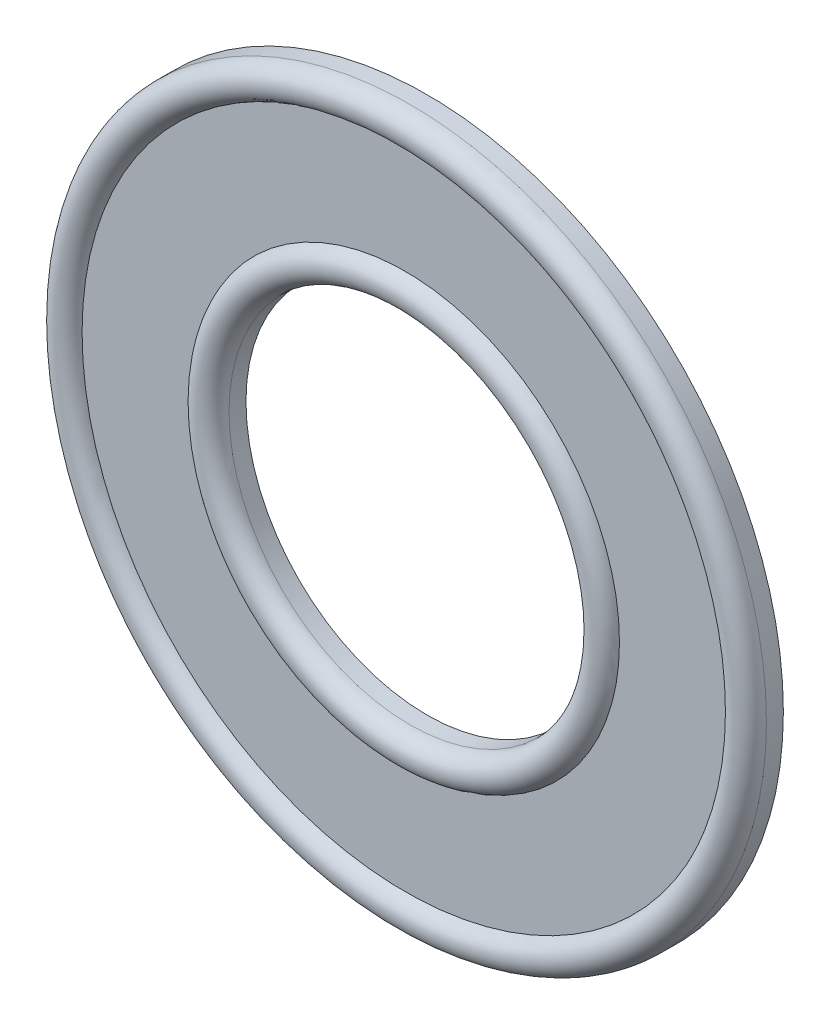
from build123d import *


with BuildPart() as part:
    # Sketch1 → Revolve1 (revolve)
    with BuildSketch(Plane(origin=(0, 0, 0), x_dir=(1, 0, 0), z_dir=(0, 1, 0))):
        with BuildLine():
            Line((16.000000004, 1.499997), (31.499999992, 1.499997))
            Line((31.499999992, 1.499997), (31.499999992, 0))
            ThreePointArc((31.499999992, 0), (30.214712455, -1.484555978), (28.561467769, -0.425003))
            Line((28.561467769, -0.425003), (18.938532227, -0.425003))
            ThreePointArc((18.938532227, -0.425003), (17.285287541, -1.484555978), (16.000000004, 0))
            Line((16.000000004, 0), (16.000000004, 1.499997))
        make_face()
    revolve(axis=Axis((0, 0, 44.055855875), (0, 0, -1)))


solid = part.part
